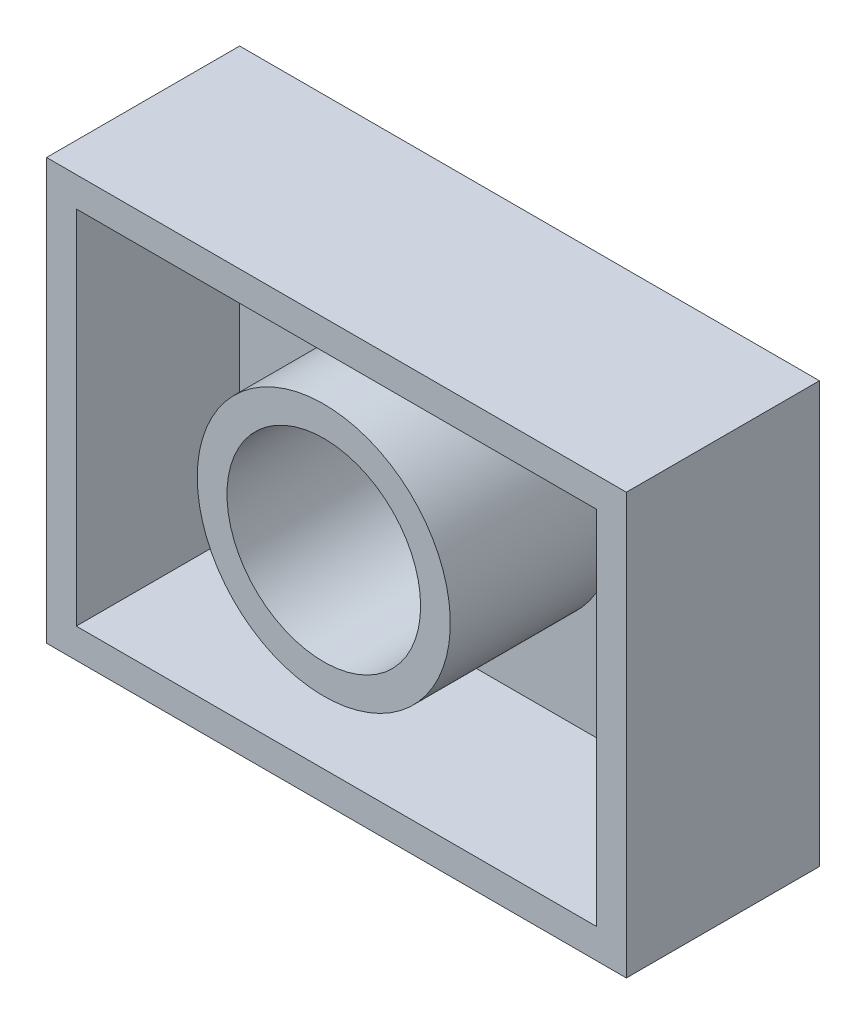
from build123d import *

# Parameters (mm, degrees)
SKETCH1_W          = 49.580976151
SKETCH1_H          = 35.977990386
EXTRUDE1_DEPTH     = 16.51
SKETCH2_R          = 8.280215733
CUT_EXTRUDE1_DEPTH = 64.44500838
SHELL1_T           = -2.54


with BuildPart() as part:
    # Sketch1 → Extrude1 (new body)
    with BuildSketch(Plane.XY):
        with Locations((24.790488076, 17.988995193)):
            Rectangle(SKETCH1_W, SKETCH1_H)
    extrude(amount=EXTRUDE1_DEPTH)

    # Sketch2 → Cut-Extrude1 (cut, through all)
    with BuildSketch(Plane.XY.offset(16.51)):
        with Locations((23.705672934, 18.751105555)):
            Circle(SKETCH2_R)
    extrude(amount=-CUT_EXTRUDE1_DEPTH, mode=Mode.SUBTRACT)

    # Shell1
    shell1_openings = [part.faces().sort_by_distance(p)[0] for p in [
        (24.790488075, 0.612591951, 16.51),
    ]]
    offset(amount=SHELL1_T, openings=shell1_openings, kind=Kind.INTERSECTION)


solid = part.part
